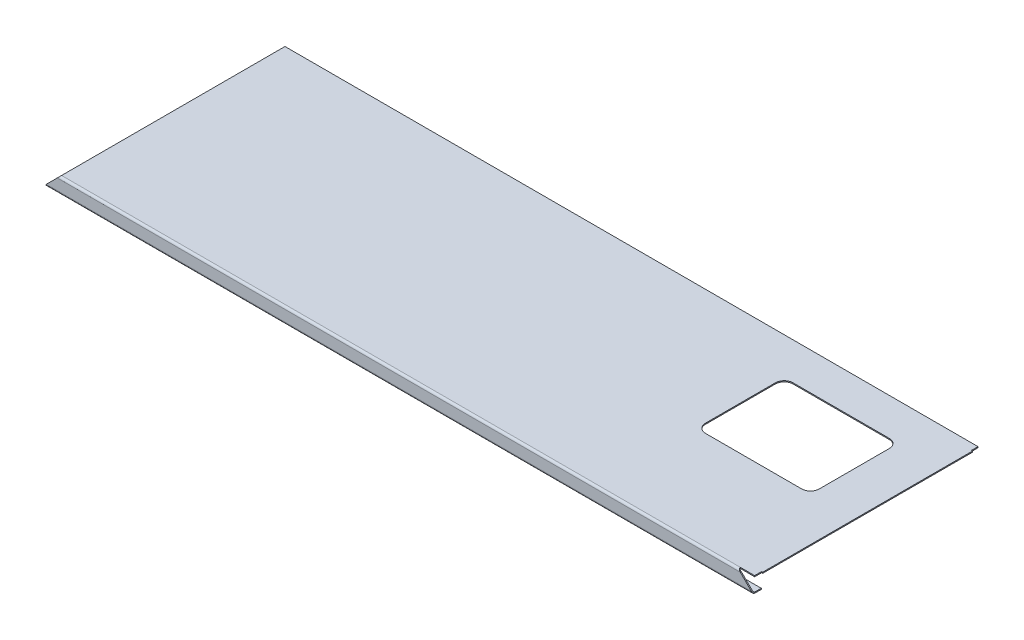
ISO-10303-21;
HEADER;
FILE_DESCRIPTION(('STEP AP214'),'2;1');
FILE_NAME('part.step','',(''),(''),'','','');
FILE_SCHEMA(('AUTOMOTIVE_DESIGN { 1 0 10303 214 1 1 1 1 }'));
ENDSEC;
DATA;
#1=APPLICATION_CONTEXT('core data for automotive mechanical design processes');
#2=APPLICATION_PROTOCOL_DEFINITION('international standard','automotive_design',2000,#1);
#3=PRODUCT_CONTEXT('',#1,'mechanical');
#4=PRODUCT('Part','Part','',(#3));
#5=PRODUCT_RELATED_PRODUCT_CATEGORY('part','',(#4));
#6=PRODUCT_DEFINITION_FORMATION('','',#4);
#7=PRODUCT_DEFINITION_CONTEXT('part definition',#1,'design');
#8=PRODUCT_DEFINITION('design','',#6,#7);
#9=PRODUCT_DEFINITION_SHAPE('','',#8);
#10=(LENGTH_UNIT() NAMED_UNIT(*) SI_UNIT(.MILLI.,.METRE.));
#11=(NAMED_UNIT(*) PLANE_ANGLE_UNIT() SI_UNIT($,.RADIAN.));
#12=(NAMED_UNIT(*) SI_UNIT($,.STERADIAN.) SOLID_ANGLE_UNIT());
#13=UNCERTAINTY_MEASURE_WITH_UNIT(LENGTH_MEASURE(1.E-05),#10,'distance_accuracy_value','');
#14=(GEOMETRIC_REPRESENTATION_CONTEXT(3) GLOBAL_UNCERTAINTY_ASSIGNED_CONTEXT((#13)) GLOBAL_UNIT_ASSIGNED_CONTEXT((#10,
#11,#12)) REPRESENTATION_CONTEXT('',''));
#15=CARTESIAN_POINT('',(0.,0.,0.));
#16=DIRECTION('',(0.,0.,1.));
#17=DIRECTION('',(1.,0.,0.));
#18=AXIS2_PLACEMENT_3D('',#15,#16,#17);
#19=CARTESIAN_POINT('',(0.,-3.048,0.));
#20=DIRECTION('',(0.,1.,0.));
#21=DIRECTION('',(0.,0.,1.));
#22=AXIS2_PLACEMENT_3D('',#19,#20,#21);
#23=PLANE('',#22);
#24=DIRECTION('',(1.,0.,0.));
#25=VECTOR('',#24,1.);
#26=CARTESIAN_POINT('',(1600.2,-3.048,107.95));
#27=LINE('',#26,#25);
#28=CARTESIAN_POINT('',(1625.6,-3.048,107.95));
#29=VERTEX_POINT('',#28);
#30=CARTESIAN_POINT('',(1905.,-3.048,107.95));
#31=VERTEX_POINT('',#30);
#32=EDGE_CURVE('E466',#29,#31,#27,.T.);
#33=ORIENTED_EDGE('',*,*,#32,.F.);
#34=CARTESIAN_POINT('',(1625.6,-3.048,133.35));
#35=DIRECTION('',(0.,1.,0.));
#36=DIRECTION('',(0.,0.,1.));
#37=AXIS2_PLACEMENT_3D('',#34,#35,#36);
#38=CIRCLE('',#37,25.4);
#39=CARTESIAN_POINT('',(1600.2,-3.048,133.35));
#40=VERTEX_POINT('',#39);
#41=EDGE_CURVE('E427',#29,#40,#38,.T.);
#42=ORIENTED_EDGE('',*,*,#41,.T.);
#43=DIRECTION('',(0.,0.,-1.));
#44=VECTOR('',#43,1.);
#45=CARTESIAN_POINT('',(1600.2,-3.048,361.95));
#46=LINE('',#45,#44);
#47=CARTESIAN_POINT('',(1600.2,-3.048,336.55));
#48=VERTEX_POINT('',#47);
#49=EDGE_CURVE('E440',#48,#40,#46,.T.);
#50=ORIENTED_EDGE('',*,*,#49,.F.);
#51=CARTESIAN_POINT('',(1625.6,-3.048,336.55));
#52=DIRECTION('',(0.,1.,0.));
#53=DIRECTION('',(0.,0.,1.));
#54=AXIS2_PLACEMENT_3D('',#51,#52,#53);
#55=CIRCLE('',#54,25.4);
#56=CARTESIAN_POINT('',(1625.6,-3.048,361.95));
#57=VERTEX_POINT('',#56);
#58=EDGE_CURVE('E96',#48,#57,#55,.T.);
#59=ORIENTED_EDGE('',*,*,#58,.T.);
#60=DIRECTION('',(-1.,0.,0.));
#61=VECTOR('',#60,1.);
#62=CARTESIAN_POINT('',(1600.2,-3.048,361.95));
#63=LINE('',#62,#61);
#64=CARTESIAN_POINT('',(1905.,-3.048,361.95));
#65=VERTEX_POINT('',#64);
#66=EDGE_CURVE('E438',#65,#57,#63,.T.);
#67=ORIENTED_EDGE('',*,*,#66,.F.);
#68=CARTESIAN_POINT('',(1905.,-3.048,336.55));
#69=DIRECTION('',(0.,1.,0.));
#70=DIRECTION('',(0.,0.,1.));
#71=AXIS2_PLACEMENT_3D('',#68,#69,#70);
#72=CIRCLE('',#71,25.4);
#73=CARTESIAN_POINT('',(1930.4,-3.048,336.55));
#74=VERTEX_POINT('',#73);
#75=EDGE_CURVE('E431',#65,#74,#72,.T.);
#76=ORIENTED_EDGE('',*,*,#75,.T.);
#77=DIRECTION('',(0.,0.,1.));
#78=VECTOR('',#77,1.);
#79=CARTESIAN_POINT('',(1930.4,-3.048,361.95));
#80=LINE('',#79,#78);
#81=CARTESIAN_POINT('',(1930.4,-3.048,133.35));
#82=VERTEX_POINT('',#81);
#83=EDGE_CURVE('E446',#82,#74,#80,.T.);
#84=ORIENTED_EDGE('',*,*,#83,.F.);
#85=CARTESIAN_POINT('',(1905.,-3.048,133.35));
#86=DIRECTION('',(0.,1.,0.));
#87=DIRECTION('',(0.,0.,1.));
#88=AXIS2_PLACEMENT_3D('',#85,#86,#87);
#89=CIRCLE('',#88,25.4);
#90=EDGE_CURVE('E423',#82,#31,#89,.T.);
#91=ORIENTED_EDGE('',*,*,#90,.T.);
#92=EDGE_LOOP('',(#33,#42,#50,#59,#67,#76,#84,#91));
#93=FACE_BOUND('',#92,.T.);
#94=DIRECTION('',(-1.,0.,0.));
#95=VECTOR('',#94,1.);
#96=CARTESIAN_POINT('',(0.,-3.048,627.1895));
#97=LINE('',#96,#95);
#98=CARTESIAN_POINT('',(2057.4,-3.048,627.1895));
#99=VERTEX_POINT('',#98);
#100=CARTESIAN_POINT('',(2054.352,-3.048,627.1895));
#101=VERTEX_POINT('',#100);
#102=EDGE_CURVE('E262',#99,#101,#97,.T.);
#103=ORIENTED_EDGE('',*,*,#102,.T.);
#104=DIRECTION('',(0.,0.,-1.));
#105=VECTOR('',#104,1.);
#106=CARTESIAN_POINT('',(2054.352,-3.048,0.));
#107=LINE('',#106,#105);
#108=CARTESIAN_POINT('',(2054.352,-3.048,647.827));
#109=VERTEX_POINT('',#108);
#110=EDGE_CURVE('E472',#109,#101,#107,.T.);
#111=ORIENTED_EDGE('',*,*,#110,.F.);
#112=DIRECTION('',(-1.,0.,0.));
#113=VECTOR('',#112,1.);
#114=CARTESIAN_POINT('',(2057.4,-3.048,647.827));
#115=LINE('',#114,#113);
#116=CARTESIAN_POINT('',(2012.95,-3.048,647.827));
#117=VERTEX_POINT('',#116);
#118=EDGE_CURVE('E285',#109,#117,#115,.T.);
#119=ORIENTED_EDGE('',*,*,#118,.T.);
#120=DIRECTION('',(-1.,0.,0.));
#121=VECTOR('',#120,1.);
#122=CARTESIAN_POINT('',(0.,-3.04800000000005,647.827));
#123=LINE('',#122,#121);
#124=CARTESIAN_POINT('',(44.4500000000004,-3.048,647.827));
#125=VERTEX_POINT('',#124);
#126=EDGE_CURVE('E393',#125,#117,#123,.F.);
#127=ORIENTED_EDGE('',*,*,#126,.F.);
#128=DIRECTION('',(0.,0.,1.));
#129=VECTOR('',#128,1.);
#130=CARTESIAN_POINT('',(44.4500000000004,-3.048,0.));
#131=LINE('',#130,#129);
#132=CARTESIAN_POINT('',(44.4500000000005,-3.048,0.));
#133=VERTEX_POINT('',#132);
#134=EDGE_CURVE('E354',#125,#133,#131,.F.);
#135=ORIENTED_EDGE('',*,*,#134,.T.);
#136=DIRECTION('',(-1.,0.,0.));
#137=VECTOR('',#136,1.);
#138=CARTESIAN_POINT('',(0.,-3.048,0.));
#139=LINE('',#138,#137);
#140=CARTESIAN_POINT('',(2054.225,-3.048,0.));
#141=VERTEX_POINT('',#140);
#142=EDGE_CURVE('E401',#141,#133,#139,.T.);
#143=ORIENTED_EDGE('',*,*,#142,.F.);
#144=DIRECTION('',(0.,0.,1.));
#145=VECTOR('',#144,1.);
#146=CARTESIAN_POINT('',(2054.225,-3.048,0.));
#147=LINE('',#146,#145);
#148=CARTESIAN_POINT('',(2054.225,-3.048,19.05));
#149=VERTEX_POINT('',#148);
#150=EDGE_CURVE('E464',#141,#149,#147,.T.);
#151=ORIENTED_EDGE('',*,*,#150,.T.);
#152=DIRECTION('',(-1.,0.,0.));
#153=VECTOR('',#152,1.);
#154=CARTESIAN_POINT('',(0.,-3.048,19.0500000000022));
#155=LINE('',#154,#153);
#156=CARTESIAN_POINT('',(2057.4,-3.048,19.05));
#157=VERTEX_POINT('',#156);
#158=EDGE_CURVE('E481',#157,#149,#155,.T.);
#159=ORIENTED_EDGE('',*,*,#158,.F.);
#160=DIRECTION('',(0.,0.,-1.));
#161=VECTOR('',#160,1.);
#162=CARTESIAN_POINT('',(2057.4,-3.048,647.827));
#163=LINE('',#162,#161);
#164=EDGE_CURVE('E283',#99,#157,#163,.T.);
#165=ORIENTED_EDGE('',*,*,#164,.F.);
#166=EDGE_LOOP('',(#103,#111,#119,#127,#135,#143,#151,#159,#165));
#167=FACE_BOUND('',#166,.T.);
#168=ADVANCED_FACE('F88',(#93,#167),#23,.F.);
#169=CARTESIAN_POINT('',(0.,0.,0.));
#170=DIRECTION('',(0.,1.,0.));
#171=DIRECTION('',(0.,0.,1.));
#172=AXIS2_PLACEMENT_3D('',#169,#170,#171);
#173=PLANE('',#172);
#174=DIRECTION('',(-1.,0.,0.));
#175=VECTOR('',#174,1.);
#176=CARTESIAN_POINT('',(1600.2,0.,361.95));
#177=LINE('',#176,#175);
#178=CARTESIAN_POINT('',(1905.,0.,361.95));
#179=VERTEX_POINT('',#178);
#180=CARTESIAN_POINT('',(1625.6,0.,361.95));
#181=VERTEX_POINT('',#180);
#182=EDGE_CURVE('E452',#179,#181,#177,.T.);
#183=ORIENTED_EDGE('',*,*,#182,.T.);
#184=CARTESIAN_POINT('',(1625.6,0.,336.55));
#185=DIRECTION('',(0.,1.,0.));
#186=DIRECTION('',(0.,0.,1.));
#187=AXIS2_PLACEMENT_3D('',#184,#185,#186);
#188=CIRCLE('',#187,25.4);
#189=CARTESIAN_POINT('',(1600.2,0.,336.55));
#190=VERTEX_POINT('',#189);
#191=EDGE_CURVE('E13',#181,#190,#188,.F.);
#192=ORIENTED_EDGE('',*,*,#191,.T.);
#193=DIRECTION('',(0.,0.,-1.));
#194=VECTOR('',#193,1.);
#195=CARTESIAN_POINT('',(1600.2,0.,361.95));
#196=LINE('',#195,#194);
#197=CARTESIAN_POINT('',(1600.2,0.,133.35));
#198=VERTEX_POINT('',#197);
#199=EDGE_CURVE('E445',#190,#198,#196,.T.);
#200=ORIENTED_EDGE('',*,*,#199,.T.);
#201=CARTESIAN_POINT('',(1625.6,0.,133.35));
#202=DIRECTION('',(0.,1.,0.));
#203=DIRECTION('',(0.,0.,1.));
#204=AXIS2_PLACEMENT_3D('',#201,#202,#203);
#205=CIRCLE('',#204,25.4);
#206=CARTESIAN_POINT('',(1625.6,0.,107.95));
#207=VERTEX_POINT('',#206);
#208=EDGE_CURVE('E429',#198,#207,#205,.F.);
#209=ORIENTED_EDGE('',*,*,#208,.T.);
#210=DIRECTION('',(1.,0.,0.));
#211=VECTOR('',#210,1.);
#212=CARTESIAN_POINT('',(1600.2,0.,107.95));
#213=LINE('',#212,#211);
#214=CARTESIAN_POINT('',(1905.,0.,107.95));
#215=VERTEX_POINT('',#214);
#216=EDGE_CURVE('E456',#207,#215,#213,.T.);
#217=ORIENTED_EDGE('',*,*,#216,.T.);
#218=CARTESIAN_POINT('',(1905.,0.,133.35));
#219=DIRECTION('',(0.,1.,0.));
#220=DIRECTION('',(0.,0.,1.));
#221=AXIS2_PLACEMENT_3D('',#218,#219,#220);
#222=CIRCLE('',#221,25.4);
#223=CARTESIAN_POINT('',(1930.4,0.,133.35));
#224=VERTEX_POINT('',#223);
#225=EDGE_CURVE('E425',#215,#224,#222,.F.);
#226=ORIENTED_EDGE('',*,*,#225,.T.);
#227=DIRECTION('',(0.,0.,1.));
#228=VECTOR('',#227,1.);
#229=CARTESIAN_POINT('',(1930.4,0.,361.95));
#230=LINE('',#229,#228);
#231=CARTESIAN_POINT('',(1930.4,0.,336.55));
#232=VERTEX_POINT('',#231);
#233=EDGE_CURVE('E459',#224,#232,#230,.T.);
#234=ORIENTED_EDGE('',*,*,#233,.T.);
#235=CARTESIAN_POINT('',(1905.,0.,336.55));
#236=DIRECTION('',(0.,1.,0.));
#237=DIRECTION('',(0.,0.,1.));
#238=AXIS2_PLACEMENT_3D('',#235,#236,#237);
#239=CIRCLE('',#238,25.4);
#240=EDGE_CURVE('E110',#232,#179,#239,.F.);
#241=ORIENTED_EDGE('',*,*,#240,.T.);
#242=EDGE_LOOP('',(#183,#192,#200,#209,#217,#226,#234,#241));
#243=FACE_BOUND('',#242,.T.);
#244=DIRECTION('',(0.,0.,1.));
#245=VECTOR('',#244,1.);
#246=CARTESIAN_POINT('',(2054.352,0.,0.));
#247=LINE('',#246,#245);
#248=CARTESIAN_POINT('',(2054.352,0.,647.827));
#249=VERTEX_POINT('',#248);
#250=CARTESIAN_POINT('',(2054.352,0.,627.1895));
#251=VERTEX_POINT('',#250);
#252=EDGE_CURVE('E277',#249,#251,#247,.F.);
#253=ORIENTED_EDGE('',*,*,#252,.T.);
#254=DIRECTION('',(1.,0.,0.));
#255=VECTOR('',#254,1.);
#256=CARTESIAN_POINT('',(0.,0.,627.1895));
#257=LINE('',#256,#255);
#258=CARTESIAN_POINT('',(2057.4,0.,627.1895));
#259=VERTEX_POINT('',#258);
#260=EDGE_CURVE('E259',#259,#251,#257,.F.);
#261=ORIENTED_EDGE('',*,*,#260,.F.);
#262=DIRECTION('',(0.,0.,1.));
#263=VECTOR('',#262,1.);
#264=CARTESIAN_POINT('',(2057.4,0.,647.827));
#265=LINE('',#264,#263);
#266=CARTESIAN_POINT('',(2057.4,0.,19.05));
#267=VERTEX_POINT('',#266);
#268=EDGE_CURVE('E275',#267,#259,#265,.T.);
#269=ORIENTED_EDGE('',*,*,#268,.F.);
#270=DIRECTION('',(1.,0.,0.));
#271=VECTOR('',#270,1.);
#272=CARTESIAN_POINT('',(0.,0.,19.05));
#273=LINE('',#272,#271);
#274=CARTESIAN_POINT('',(2054.225,0.,19.05));
#275=VERTEX_POINT('',#274);
#276=EDGE_CURVE('E480',#267,#275,#273,.F.);
#277=ORIENTED_EDGE('',*,*,#276,.T.);
#278=DIRECTION('',(0.,0.,1.));
#279=VECTOR('',#278,1.);
#280=CARTESIAN_POINT('',(2054.225,0.,0.));
#281=LINE('',#280,#279);
#282=CARTESIAN_POINT('',(2054.225,0.,0.));
#283=VERTEX_POINT('',#282);
#284=EDGE_CURVE('E478',#283,#275,#281,.T.);
#285=ORIENTED_EDGE('',*,*,#284,.F.);
#286=DIRECTION('',(-1.,0.,0.));
#287=VECTOR('',#286,1.);
#288=CARTESIAN_POINT('',(0.,0.,0.));
#289=LINE('',#288,#287);
#290=CARTESIAN_POINT('',(44.4500000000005,0.,0.));
#291=VERTEX_POINT('',#290);
#292=EDGE_CURVE('E398',#283,#291,#289,.T.);
#293=ORIENTED_EDGE('',*,*,#292,.T.);
#294=DIRECTION('',(0.,0.,-1.));
#295=VECTOR('',#294,1.);
#296=CARTESIAN_POINT('',(44.4500000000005,0.,3353.19684582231));
#297=LINE('',#296,#295);
#298=CARTESIAN_POINT('',(44.4500000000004,0.,647.827));
#299=VERTEX_POINT('',#298);
#300=EDGE_CURVE('E331',#299,#291,#297,.T.);
#301=ORIENTED_EDGE('',*,*,#300,.F.);
#302=DIRECTION('',(-1.,0.,0.));
#303=VECTOR('',#302,1.);
#304=CARTESIAN_POINT('',(0.,0.,647.827));
#305=LINE('',#304,#303);
#306=CARTESIAN_POINT('',(2012.95,0.,647.827));
#307=VERTEX_POINT('',#306);
#308=EDGE_CURVE('E395',#299,#307,#305,.F.);
#309=ORIENTED_EDGE('',*,*,#308,.T.);
#310=DIRECTION('',(-1.,0.,0.));
#311=VECTOR('',#310,1.);
#312=CARTESIAN_POINT('',(2057.4,0.,647.827));
#313=LINE('',#312,#311);
#314=EDGE_CURVE('E282',#249,#307,#313,.T.);
#315=ORIENTED_EDGE('',*,*,#314,.F.);
#316=EDGE_LOOP('',(#253,#261,#269,#277,#285,#293,#301,#309,#315));
#317=FACE_BOUND('',#316,.T.);
#318=ADVANCED_FACE('F273',(#243,#317),#173,.T.);
#319=CARTESIAN_POINT('',(0.,-3.048,0.));
#320=DIRECTION('',(0.,0.,-1.));
#321=DIRECTION('',(-1.,0.,0.));
#322=AXIS2_PLACEMENT_3D('',#319,#320,#321);
#323=PLANE('',#322);
#324=ORIENTED_EDGE('',*,*,#292,.F.);
#325=DIRECTION('',(0.,-1.,0.));
#326=VECTOR('',#325,1.);
#327=CARTESIAN_POINT('',(2054.225,-3.048,0.));
#328=LINE('',#327,#326);
#329=EDGE_CURVE('E483',#141,#283,#328,.F.);
#330=ORIENTED_EDGE('',*,*,#329,.F.);
#331=ORIENTED_EDGE('',*,*,#142,.T.);
#332=DIRECTION('',(0.,1.,0.));
#333=VECTOR('',#332,1.);
#334=CARTESIAN_POINT('',(44.4500000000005,0.,0.));
#335=LINE('',#334,#333);
#336=EDGE_CURVE('E357',#291,#133,#335,.F.);
#337=ORIENTED_EDGE('',*,*,#336,.F.);
#338=EDGE_LOOP('',(#324,#330,#331,#337));
#339=FACE_BOUND('',#338,.T.);
#340=ADVANCED_FACE('F500',(#339),#323,.T.);
#341=CARTESIAN_POINT('',(2057.4,0.,647.827));
#342=DIRECTION('',(0.,0.,-1.));
#343=DIRECTION('',(-1.,0.,0.));
#344=AXIS2_PLACEMENT_3D('',#341,#342,#343);
#345=PLANE('',#344);
#346=DIRECTION('',(0.,-1.,0.));
#347=VECTOR('',#346,1.);
#348=CARTESIAN_POINT('',(2054.352,-3.048,647.827));
#349=LINE('',#348,#347);
#350=EDGE_CURVE('E268',#109,#249,#349,.F.);
#351=ORIENTED_EDGE('',*,*,#350,.T.);
#352=ORIENTED_EDGE('',*,*,#314,.T.);
#353=DIRECTION('',(0.,1.,0.));
#354=VECTOR('',#353,1.);
#355=CARTESIAN_POINT('',(2012.95,0.,647.827));
#356=LINE('',#355,#354);
#357=EDGE_CURVE('E313',#307,#117,#356,.F.);
#358=ORIENTED_EDGE('',*,*,#357,.T.);
#359=ORIENTED_EDGE('',*,*,#118,.F.);
#360=EDGE_LOOP('',(#351,#352,#358,#359));
#361=FACE_BOUND('',#360,.T.);
#362=ADVANCED_FACE('F517',(#361),#345,.F.);
#363=CARTESIAN_POINT('',(2057.4,0.,0.));
#364=DIRECTION('',(1.,0.,0.));
#365=DIRECTION('',(0.,0.,-1.));
#366=AXIS2_PLACEMENT_3D('',#363,#364,#365);
#367=PLANE('',#366);
#368=ORIENTED_EDGE('',*,*,#268,.T.);
#369=DIRECTION('',(0.,-1.,0.));
#370=VECTOR('',#369,1.);
#371=CARTESIAN_POINT('',(2057.4,-3.048,627.1895));
#372=LINE('',#371,#370);
#373=EDGE_CURVE('E255',#99,#259,#372,.F.);
#374=ORIENTED_EDGE('',*,*,#373,.F.);
#375=ORIENTED_EDGE('',*,*,#164,.T.);
#376=DIRECTION('',(0.,-1.,0.));
#377=VECTOR('',#376,1.);
#378=CARTESIAN_POINT('',(2057.4,-3.048,19.05));
#379=LINE('',#378,#377);
#380=EDGE_CURVE('E281',#157,#267,#379,.F.);
#381=ORIENTED_EDGE('',*,*,#380,.T.);
#382=EDGE_LOOP('',(#368,#374,#375,#381));
#383=FACE_BOUND('',#382,.T.);
#384=ADVANCED_FACE('F280',(#383),#367,.T.);
#385=CARTESIAN_POINT('',(0.,1.76452196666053E-12,654.05));
#386=DIRECTION('',(0.,0.,-1.));
#387=DIRECTION('',(0.,1.,0.));
#388=AXIS2_PLACEMENT_3D('',#385,#386,#387);
#389=PLANE('',#388);
#390=DIRECTION('',(-0.707106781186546,0.707106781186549,0.));
#391=VECTOR('',#390,1.);
#392=CARTESIAN_POINT('',(1006.475,1006.475,654.049999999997));
#393=LINE('',#392,#391);
#394=CARTESIAN_POINT('',(2051.177,-38.227,654.05));
#395=VERTEX_POINT('',#394);
#396=CARTESIAN_POINT('',(2019.173,-6.22300000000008,654.05));
#397=VERTEX_POINT('',#396);
#398=EDGE_CURVE('E303',#395,#397,#393,.T.);
#399=ORIENTED_EDGE('',*,*,#398,.T.);
#400=DIRECTION('',(-1.,0.,0.));
#401=VECTOR('',#400,1.);
#402=CARTESIAN_POINT('',(2057.4,-6.22300000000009,654.05));
#403=LINE('',#402,#401);
#404=CARTESIAN_POINT('',(38.2270000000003,-6.22300000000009,654.05));
#405=VERTEX_POINT('',#404);
#406=EDGE_CURVE('E390',#405,#397,#403,.F.);
#407=ORIENTED_EDGE('',*,*,#406,.F.);
#408=DIRECTION('',(0.707106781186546,0.707106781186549,0.));
#409=VECTOR('',#408,1.);
#410=CARTESIAN_POINT('',(22.2250000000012,-22.2249999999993,654.05));
#411=LINE('',#410,#409);
#412=CARTESIAN_POINT('',(6.22300000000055,-38.227,654.05));
#413=VERTEX_POINT('',#412);
#414=EDGE_CURVE('E351',#413,#405,#411,.T.);
#415=ORIENTED_EDGE('',*,*,#414,.F.);
#416=DIRECTION('',(-1.,0.,0.));
#417=VECTOR('',#416,1.);
#418=CARTESIAN_POINT('',(4.44089209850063E-13,-38.227,654.05));
#419=LINE('',#418,#417);
#420=EDGE_CURVE('E384',#413,#395,#419,.F.);
#421=ORIENTED_EDGE('',*,*,#420,.T.);
#422=EDGE_LOOP('',(#399,#407,#415,#421));
#423=FACE_BOUND('',#422,.T.);
#424=ADVANCED_FACE('F523',(#423),#389,.F.);
#425=CARTESIAN_POINT('',(0.,1.75387993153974E-12,651.002));
#426=DIRECTION('',(0.,0.,-1.));
#427=DIRECTION('',(0.,1.,0.));
#428=AXIS2_PLACEMENT_3D('',#425,#426,#427);
#429=PLANE('',#428);
#430=DIRECTION('',(-1.,0.,0.));
#431=VECTOR('',#430,1.);
#432=CARTESIAN_POINT('',(2057.4,-6.22300000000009,651.002));
#433=LINE('',#432,#431);
#434=CARTESIAN_POINT('',(2019.173,-6.22300000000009,651.002));
#435=VERTEX_POINT('',#434);
#436=CARTESIAN_POINT('',(38.2270000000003,-6.22300000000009,651.002));
#437=VERTEX_POINT('',#436);
#438=EDGE_CURVE('E387',#435,#437,#433,.T.);
#439=ORIENTED_EDGE('',*,*,#438,.F.);
#440=DIRECTION('',(-0.707106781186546,0.707106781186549,0.));
#441=VECTOR('',#440,1.);
#442=CARTESIAN_POINT('',(1006.475,1006.475,651.001999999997));
#443=LINE('',#442,#441);
#444=CARTESIAN_POINT('',(2051.177,-38.227,651.002));
#445=VERTEX_POINT('',#444);
#446=EDGE_CURVE('E307',#445,#435,#443,.T.);
#447=ORIENTED_EDGE('',*,*,#446,.F.);
#448=DIRECTION('',(-1.,0.,0.));
#449=VECTOR('',#448,1.);
#450=CARTESIAN_POINT('',(4.44089209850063E-13,-38.227,651.002));
#451=LINE('',#450,#449);
#452=CARTESIAN_POINT('',(6.22300000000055,-38.227,651.002));
#453=VERTEX_POINT('',#452);
#454=EDGE_CURVE('E378',#453,#445,#451,.F.);
#455=ORIENTED_EDGE('',*,*,#454,.F.);
#456=DIRECTION('',(0.707106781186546,0.707106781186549,0.));
#457=VECTOR('',#456,1.);
#458=CARTESIAN_POINT('',(22.2250000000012,-22.2249999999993,651.002));
#459=LINE('',#458,#457);
#460=EDGE_CURVE('E364',#453,#437,#459,.T.);
#461=ORIENTED_EDGE('',*,*,#460,.T.);
#462=EDGE_LOOP('',(#439,#447,#455,#461));
#463=FACE_BOUND('',#462,.T.);
#464=ADVANCED_FACE('F555',(#463),#429,.T.);
#465=CARTESIAN_POINT('',(0.,-6.22300000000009,647.827));
#466=DIRECTION('',(-1.,0.,0.));
#467=DIRECTION('',(0.,0.,1.));
#468=AXIS2_PLACEMENT_3D('',#465,#466,#467);
#469=CYLINDRICAL_SURFACE('',#468,6.22300000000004);
#470=ORIENTED_EDGE('',*,*,#406,.T.);
#471=CARTESIAN_POINT('',(2019.173,-6.22300000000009,647.827));
#472=DIRECTION('',(-0.707106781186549,-0.707106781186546,0.));
#473=DIRECTION('',(-0.707106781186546,0.707106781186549,0.));
#474=AXIS2_PLACEMENT_3D('',#471,#472,#473);
#475=ELLIPSE('',#474,8.80065099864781,6.22300000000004);
#476=EDGE_CURVE('E296',#307,#397,#475,.F.);
#477=ORIENTED_EDGE('',*,*,#476,.F.);
#478=ORIENTED_EDGE('',*,*,#308,.F.);
#479=CARTESIAN_POINT('',(38.2270000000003,-6.22300000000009,647.827));
#480=DIRECTION('',(-0.707106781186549,0.707106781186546,0.));
#481=DIRECTION('',(-0.707106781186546,-0.707106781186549,0.));
#482=AXIS2_PLACEMENT_3D('',#479,#480,#481);
#483=ELLIPSE('',#482,8.80065099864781,6.22300000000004);
#484=EDGE_CURVE('E332',#299,#405,#483,.F.);
#485=ORIENTED_EDGE('',*,*,#484,.T.);
#486=EDGE_LOOP('',(#470,#477,#478,#485));
#487=FACE_BOUND('',#486,.T.);
#488=ADVANCED_FACE('F520',(#487),#469,.T.);
#489=CARTESIAN_POINT('',(0.,-6.22300000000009,647.827));
#490=DIRECTION('',(-1.,0.,0.));
#491=DIRECTION('',(0.,0.,1.));
#492=AXIS2_PLACEMENT_3D('',#489,#490,#491);
#493=CYLINDRICAL_SURFACE('',#492,3.17500000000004);
#494=CARTESIAN_POINT('',(2019.173,-6.22300000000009,647.827));
#495=DIRECTION('',(-0.454470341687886,-0.890761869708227,0.));
#496=DIRECTION('',(-0.890761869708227,0.454470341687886,0.));
#497=AXIS2_PLACEMENT_3D('',#494,#495,#496);
#498=ELLIPSE('',#497,6.98615445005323,3.17500000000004);
#499=EDGE_CURVE('E292',#117,#435,#498,.F.);
#500=ORIENTED_EDGE('',*,*,#499,.T.);
#501=ORIENTED_EDGE('',*,*,#438,.T.);
#502=CARTESIAN_POINT('',(38.2270000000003,-6.22300000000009,647.827));
#503=DIRECTION('',(-0.454470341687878,0.890761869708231,0.));
#504=DIRECTION('',(-0.890761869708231,-0.454470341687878,0.));
#505=AXIS2_PLACEMENT_3D('',#502,#503,#504);
#506=ELLIPSE('',#505,6.98615445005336,3.17500000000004);
#507=EDGE_CURVE('E328',#125,#437,#506,.F.);
#508=ORIENTED_EDGE('',*,*,#507,.F.);
#509=ORIENTED_EDGE('',*,*,#126,.T.);
#510=EDGE_LOOP('',(#500,#501,#508,#509));
#511=FACE_BOUND('',#510,.T.);
#512=ADVANCED_FACE('F510',(#511),#493,.F.);
#513=CARTESIAN_POINT('',(4.44089209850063E-13,-38.227,647.827));
#514=DIRECTION('',(-1.,0.,0.));
#515=DIRECTION('',(0.,-1.,0.));
#516=AXIS2_PLACEMENT_3D('',#513,#514,#515);
#517=CYLINDRICAL_SURFACE('',#516,6.22299999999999);
#518=DIRECTION('',(-1.,0.,0.));
#519=VECTOR('',#518,1.);
#520=CARTESIAN_POINT('',(0.,-44.45,647.827));
#521=LINE('',#520,#519);
#522=CARTESIAN_POINT('',(2054.352,-44.45,647.827));
#523=VERTEX_POINT('',#522);
#524=CARTESIAN_POINT('',(3.04800000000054,-44.45,647.827));
#525=VERTEX_POINT('',#524);
#526=EDGE_CURVE('E381',#523,#525,#521,.T.);
#527=ORIENTED_EDGE('',*,*,#526,.F.);
#528=CARTESIAN_POINT('',(2051.177,-38.227,647.827));
#529=DIRECTION('',(-0.890761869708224,-0.454470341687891,0.));
#530=DIRECTION('',(-0.454470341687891,0.890761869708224,0.));
#531=AXIS2_PLACEMENT_3D('',#528,#529,#530);
#532=ELLIPSE('',#531,6.9861544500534,6.22299999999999);
#533=EDGE_CURVE('E299',#395,#523,#532,.F.);
#534=ORIENTED_EDGE('',*,*,#533,.F.);
#535=ORIENTED_EDGE('',*,*,#420,.F.);
#536=CARTESIAN_POINT('',(6.22300000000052,-38.227,647.827));
#537=DIRECTION('',(-0.890761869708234,0.454470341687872,0.));
#538=DIRECTION('',(-0.454470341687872,-0.890761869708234,0.));
#539=AXIS2_PLACEMENT_3D('',#536,#537,#538);
#540=ELLIPSE('',#539,6.98615445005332,6.22299999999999);
#541=EDGE_CURVE('E335',#413,#525,#540,.F.);
#542=ORIENTED_EDGE('',*,*,#541,.T.);
#543=EDGE_LOOP('',(#527,#534,#535,#542));
#544=FACE_BOUND('',#543,.T.);
#545=ADVANCED_FACE('F535',(#544),#517,.T.);
#546=CARTESIAN_POINT('',(4.44089209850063E-13,-38.227,647.827));
#547=DIRECTION('',(-1.,0.,0.));
#548=DIRECTION('',(0.,-1.,0.));
#549=AXIS2_PLACEMENT_3D('',#546,#547,#548);
#550=CYLINDRICAL_SURFACE('',#549,3.17499999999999);
#551=CARTESIAN_POINT('',(2051.177,-38.227,647.827));
#552=DIRECTION('',(-0.707106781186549,-0.707106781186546,0.));
#553=DIRECTION('',(-0.707106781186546,0.707106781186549,0.));
#554=AXIS2_PLACEMENT_3D('',#551,#552,#553);
#555=ELLIPSE('',#554,4.49012806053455,3.17499999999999);
#556=CARTESIAN_POINT('',(2054.352,-41.402,647.827));
#557=VERTEX_POINT('',#556);
#558=EDGE_CURVE('E291',#445,#557,#555,.F.);
#559=ORIENTED_EDGE('',*,*,#558,.T.);
#560=DIRECTION('',(1.,0.,0.));
#561=VECTOR('',#560,1.);
#562=CARTESIAN_POINT('',(2057.4,-41.402,647.827));
#563=LINE('',#562,#561);
#564=CARTESIAN_POINT('',(3.04800000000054,-41.402,647.827));
#565=VERTEX_POINT('',#564);
#566=EDGE_CURVE('E373',#557,#565,#563,.F.);
#567=ORIENTED_EDGE('',*,*,#566,.T.);
#568=CARTESIAN_POINT('',(6.22300000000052,-38.227,647.827));
#569=DIRECTION('',(-0.707106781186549,0.707106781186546,0.));
#570=DIRECTION('',(-0.707106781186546,-0.707106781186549,0.));
#571=AXIS2_PLACEMENT_3D('',#568,#569,#570);
#572=ELLIPSE('',#571,4.49012806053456,3.17499999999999);
#573=EDGE_CURVE('E327',#453,#565,#572,.F.);
#574=ORIENTED_EDGE('',*,*,#573,.F.);
#575=ORIENTED_EDGE('',*,*,#454,.T.);
#576=EDGE_LOOP('',(#559,#567,#574,#575));
#577=FACE_BOUND('',#576,.T.);
#578=ADVANCED_FACE('F552',(#577),#550,.F.);
#579=CARTESIAN_POINT('',(0.,-44.450000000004,2.86620769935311E-13));
#580=DIRECTION('',(0.,-1.,0.));
#581=DIRECTION('',(0.,0.,-1.));
#582=AXIS2_PLACEMENT_3D('',#579,#580,#581);
#583=PLANE('',#582);
#584=DIRECTION('',(-1.,0.,0.));
#585=VECTOR('',#584,1.);
#586=CARTESIAN_POINT('',(0.,-44.4500000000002,628.65));
#587=LINE('',#586,#585);
#588=CARTESIAN_POINT('',(2054.352,-44.4500000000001,628.65));
#589=VERTEX_POINT('',#588);
#590=CARTESIAN_POINT('',(3.04800000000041,-44.4500000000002,628.65));
#591=VERTEX_POINT('',#590);
#592=EDGE_CURVE('E376',#589,#591,#587,.T.);
#593=ORIENTED_EDGE('',*,*,#592,.F.);
#594=DIRECTION('',(0.,0.,-1.));
#595=VECTOR('',#594,1.);
#596=CARTESIAN_POINT('',(2054.352,-44.450000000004,2.86729569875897E-13));
#597=LINE('',#596,#595);
#598=EDGE_CURVE('E316',#523,#589,#597,.T.);
#599=ORIENTED_EDGE('',*,*,#598,.F.);
#600=ORIENTED_EDGE('',*,*,#526,.T.);
#601=DIRECTION('',(0.,0.,-1.));
#602=VECTOR('',#601,1.);
#603=CARTESIAN_POINT('',(3.04800000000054,-44.450000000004,2.86729569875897E-13));
#604=LINE('',#603,#602);
#605=EDGE_CURVE('E340',#525,#591,#604,.T.);
#606=ORIENTED_EDGE('',*,*,#605,.T.);
#607=EDGE_LOOP('',(#593,#599,#600,#606));
#608=FACE_BOUND('',#607,.T.);
#609=ADVANCED_FACE('F541',(#608),#583,.T.);
#610=CARTESIAN_POINT('',(0.,-41.402000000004,2.67805313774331E-13));
#611=DIRECTION('',(0.,-1.,0.));
#612=DIRECTION('',(0.,0.,-1.));
#613=AXIS2_PLACEMENT_3D('',#610,#611,#612);
#614=PLANE('',#613);
#615=DIRECTION('',(0.,0.,-1.));
#616=VECTOR('',#615,1.);
#617=CARTESIAN_POINT('',(2054.352,-41.402000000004,1.30227539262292E-11));
#618=LINE('',#617,#616);
#619=CARTESIAN_POINT('',(2054.352,-41.4020000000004,628.65));
#620=VERTEX_POINT('',#619);
#621=EDGE_CURVE('E295',#557,#620,#618,.T.);
#622=ORIENTED_EDGE('',*,*,#621,.T.);
#623=DIRECTION('',(1.,0.,0.));
#624=VECTOR('',#623,1.);
#625=CARTESIAN_POINT('',(0.,-41.4020000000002,628.65));
#626=LINE('',#625,#624);
#627=CARTESIAN_POINT('',(3.04800000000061,-41.4020000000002,628.65));
#628=VERTEX_POINT('',#627);
#629=EDGE_CURVE('E379',#620,#628,#626,.F.);
#630=ORIENTED_EDGE('',*,*,#629,.T.);
#631=DIRECTION('',(0.,0.,-1.));
#632=VECTOR('',#631,1.);
#633=CARTESIAN_POINT('',(3.04799999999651,-41.402000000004,2.48881057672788E-13));
#634=LINE('',#633,#632);
#635=EDGE_CURVE('E344',#565,#628,#634,.T.);
#636=ORIENTED_EDGE('',*,*,#635,.F.);
#637=ORIENTED_EDGE('',*,*,#566,.F.);
#638=EDGE_LOOP('',(#622,#630,#636,#637));
#639=FACE_BOUND('',#638,.T.);
#640=ADVANCED_FACE('F568',(#639),#614,.F.);
#641=CARTESIAN_POINT('',(0.,-44.4500000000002,628.65));
#642=DIRECTION('',(0.,0.,-1.));
#643=DIRECTION('',(0.,1.,0.));
#644=AXIS2_PLACEMENT_3D('',#641,#642,#643);
#645=PLANE('',#644);
#646=ORIENTED_EDGE('',*,*,#629,.F.);
#647=DIRECTION('',(0.,1.,0.));
#648=VECTOR('',#647,1.);
#649=CARTESIAN_POINT('',(2054.352,-41.4020000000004,628.65));
#650=LINE('',#649,#648);
#651=EDGE_CURVE('E310',#620,#589,#650,.F.);
#652=ORIENTED_EDGE('',*,*,#651,.T.);
#653=ORIENTED_EDGE('',*,*,#592,.T.);
#654=DIRECTION('',(0.,1.,0.));
#655=VECTOR('',#654,1.);
#656=CARTESIAN_POINT('',(3.04800000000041,-41.4020000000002,628.65));
#657=LINE('',#656,#655);
#658=EDGE_CURVE('E348',#628,#591,#657,.F.);
#659=ORIENTED_EDGE('',*,*,#658,.F.);
#660=EDGE_LOOP('',(#646,#652,#653,#659));
#661=FACE_BOUND('',#660,.T.);
#662=ADVANCED_FACE('F561',(#661),#645,.T.);
#663=CARTESIAN_POINT('',(22.2250000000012,-22.2249999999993,654.05));
#664=DIRECTION('',(-0.707106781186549,0.707106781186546,0.));
#665=DIRECTION('',(0.707106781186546,0.707106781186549,0.));
#666=AXIS2_PLACEMENT_3D('',#663,#664,#665);
#667=PLANE('',#666);
#668=ORIENTED_EDGE('',*,*,#414,.T.);
#669=DIRECTION('',(0.,0.,1.));
#670=VECTOR('',#669,1.);
#671=CARTESIAN_POINT('',(38.2270000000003,-6.22300000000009,654.05));
#672=LINE('',#671,#670);
#673=EDGE_CURVE('E370',#405,#437,#672,.F.);
#674=ORIENTED_EDGE('',*,*,#673,.T.);
#675=ORIENTED_EDGE('',*,*,#460,.F.);
#676=DIRECTION('',(0.,0.,1.));
#677=VECTOR('',#676,1.);
#678=CARTESIAN_POINT('',(6.22300000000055,-38.227,654.05));
#679=LINE('',#678,#677);
#680=EDGE_CURVE('E367',#413,#453,#679,.F.);
#681=ORIENTED_EDGE('',*,*,#680,.F.);
#682=EDGE_LOOP('',(#668,#674,#675,#681));
#683=FACE_BOUND('',#682,.T.);
#684=ADVANCED_FACE('F559',(#683),#667,.T.);
#685=CARTESIAN_POINT('',(3.04799999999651,-41.402000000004,2.48881057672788E-13));
#686=DIRECTION('',(-1.,0.,0.));
#687=DIRECTION('',(0.,0.,-1.));
#688=AXIS2_PLACEMENT_3D('',#685,#686,#687);
#689=PLANE('',#688);
#690=ORIENTED_EDGE('',*,*,#635,.T.);
#691=ORIENTED_EDGE('',*,*,#658,.T.);
#692=ORIENTED_EDGE('',*,*,#605,.F.);
#693=DIRECTION('',(0.,1.,0.));
#694=VECTOR('',#693,1.);
#695=CARTESIAN_POINT('',(3.04800000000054,-41.402,647.827));
#696=LINE('',#695,#694);
#697=EDGE_CURVE('E343',#565,#525,#696,.F.);
#698=ORIENTED_EDGE('',*,*,#697,.F.);
#699=EDGE_LOOP('',(#690,#691,#692,#698));
#700=FACE_BOUND('',#699,.T.);
#701=ADVANCED_FACE('F544',(#700),#689,.T.);
#702=CARTESIAN_POINT('',(3.04800000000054,-44.45,647.827));
#703=CARTESIAN_POINT('',(3.04800000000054,-43.434,647.827));
#704=CARTESIAN_POINT('',(3.04800000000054,-42.418,647.827));
#705=CARTESIAN_POINT('',(3.04800000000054,-41.402,647.827));
#706=CARTESIAN_POINT('',(3.04800000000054,-44.45,635.381));
#707=CARTESIAN_POINT('',(3.04800000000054,-43.434,637.413));
#708=CARTESIAN_POINT('',(3.04800000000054,-42.418,639.445));
#709=CARTESIAN_POINT('',(3.04800000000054,-41.402,641.477));
#710=CARTESIAN_POINT('',(9.3980000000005,-32.004,635.381));
#711=CARTESIAN_POINT('',(9.39800000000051,-33.0200000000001,637.413));
#712=CARTESIAN_POINT('',(9.39800000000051,-34.036,639.445));
#713=CARTESIAN_POINT('',(9.3980000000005,-35.052,641.477));
#714=CARTESIAN_POINT('',(9.3980000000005,-32.004,647.827));
#715=CARTESIAN_POINT('',(9.3980000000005,-33.02,647.827));
#716=CARTESIAN_POINT('',(9.3980000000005,-34.036,647.827));
#717=CARTESIAN_POINT('',(9.3980000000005,-35.052,647.827));
#718=CARTESIAN_POINT('',(9.3980000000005,-32.004,660.273));
#719=CARTESIAN_POINT('',(9.39800000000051,-33.0200000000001,658.241));
#720=CARTESIAN_POINT('',(9.39800000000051,-34.036,656.209));
#721=CARTESIAN_POINT('',(9.3980000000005,-35.052,654.177));
#722=CARTESIAN_POINT('',(3.04800000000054,-44.45,660.273));
#723=CARTESIAN_POINT('',(3.04800000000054,-43.434,658.241));
#724=CARTESIAN_POINT('',(3.04800000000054,-42.418,656.209));
#725=CARTESIAN_POINT('',(3.04800000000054,-41.402,654.177));
#726=CARTESIAN_POINT('',(3.04800000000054,-44.45,647.827));
#727=CARTESIAN_POINT('',(3.04800000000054,-43.434,647.827));
#728=CARTESIAN_POINT('',(3.04800000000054,-42.418,647.827));
#729=CARTESIAN_POINT('',(3.04800000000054,-41.402,647.827));
#730=(BOUNDED_SURFACE() B_SPLINE_SURFACE(3,3,((#702,#703,#704,#705),(#706,#707,#708,#709),(#710,
#711,#712,#713),(#714,#715,#716,#717),(#718,#719,#720,#721),(#722,#723,#724,#725),(#726,#727,
#728,#729)),.UNSPECIFIED.,.T.,.F.,.F.) B_SPLINE_SURFACE_WITH_KNOTS((4,3,4),(4,4),(0.,0.5,1.),
(0.,1.),.UNSPECIFIED.) GEOMETRIC_REPRESENTATION_ITEM() RATIONAL_B_SPLINE_SURFACE(((1.,1.,1.,1.),
(0.333333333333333,0.333333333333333,0.333333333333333,0.333333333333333),(0.333333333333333,
0.333333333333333,0.333333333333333,0.333333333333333),(1.,1.,1.,1.),(0.333333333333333,
0.333333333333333,0.333333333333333,0.333333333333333),(0.333333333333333,0.333333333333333,
0.333333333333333,0.333333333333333),(1.,1.,1.,1.))) REPRESENTATION_ITEM('') SURFACE());
#731=ORIENTED_EDGE('',*,*,#573,.T.);
#732=ORIENTED_EDGE('',*,*,#697,.T.);
#733=ORIENTED_EDGE('',*,*,#541,.F.);
#734=ORIENTED_EDGE('',*,*,#680,.T.);
#735=EDGE_LOOP('',(#731,#732,#733,#734));
#736=FACE_BOUND('',#735,.T.);
#737=ADVANCED_FACE('F548',(#736),#730,.F.);
#738=CARTESIAN_POINT('',(44.4500000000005,0.,3353.19684582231));
#739=DIRECTION('',(1.,0.,0.));
#740=DIRECTION('',(0.,0.,-1.));
#741=AXIS2_PLACEMENT_3D('',#738,#739,#740);
#742=PLANE('',#741);
#743=DIRECTION('',(0.,1.,0.));
#744=VECTOR('',#743,1.);
#745=CARTESIAN_POINT('',(44.4500000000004,0.,647.827));
#746=LINE('',#745,#744);
#747=EDGE_CURVE('E347',#299,#125,#746,.F.);
#748=ORIENTED_EDGE('',*,*,#747,.F.);
#749=ORIENTED_EDGE('',*,*,#300,.T.);
#750=ORIENTED_EDGE('',*,*,#336,.T.);
#751=ORIENTED_EDGE('',*,*,#134,.F.);
#752=EDGE_LOOP('',(#748,#749,#750,#751));
#753=FACE_BOUND('',#752,.T.);
#754=ADVANCED_FACE('F503',(#753),#742,.F.);
#755=CARTESIAN_POINT('',(32.0040000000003,-12.4460000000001,647.827));
#756=CARTESIAN_POINT('',(32.0040000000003,-11.4300000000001,647.827));
#757=CARTESIAN_POINT('',(32.0040000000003,-10.4140000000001,647.827));
#758=CARTESIAN_POINT('',(32.0040000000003,-9.39800000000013,647.827));
#759=CARTESIAN_POINT('',(32.0040000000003,-12.4460000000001,635.381));
#760=CARTESIAN_POINT('',(32.0040000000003,-11.4300000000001,637.413));
#761=CARTESIAN_POINT('',(32.0040000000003,-10.4140000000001,639.445));
#762=CARTESIAN_POINT('',(32.0040000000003,-9.39800000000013,641.477));
#763=CARTESIAN_POINT('',(44.4500000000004,0.,635.381));
#764=CARTESIAN_POINT('',(44.4500000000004,-1.01600000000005,637.413));
#765=CARTESIAN_POINT('',(44.4500000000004,-2.03200000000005,639.445));
#766=CARTESIAN_POINT('',(44.4500000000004,-3.04800000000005,641.477));
#767=CARTESIAN_POINT('',(44.4500000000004,0.,647.827));
#768=CARTESIAN_POINT('',(44.4500000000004,-1.01600000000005,647.827));
#769=CARTESIAN_POINT('',(44.4500000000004,-2.03200000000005,647.827));
#770=CARTESIAN_POINT('',(44.4500000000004,-3.04800000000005,647.827));
#771=CARTESIAN_POINT('',(44.4500000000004,0.,660.273));
#772=CARTESIAN_POINT('',(44.4500000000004,-1.01600000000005,658.241));
#773=CARTESIAN_POINT('',(44.4500000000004,-2.03200000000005,656.209));
#774=CARTESIAN_POINT('',(44.4500000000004,-3.04800000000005,654.177));
#775=CARTESIAN_POINT('',(32.0040000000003,-12.4460000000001,660.273));
#776=CARTESIAN_POINT('',(32.0040000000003,-11.4300000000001,658.241));
#777=CARTESIAN_POINT('',(32.0040000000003,-10.4140000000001,656.209));
#778=CARTESIAN_POINT('',(32.0040000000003,-9.39800000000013,654.177));
#779=CARTESIAN_POINT('',(32.0040000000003,-12.4460000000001,647.827));
#780=CARTESIAN_POINT('',(32.0040000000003,-11.4300000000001,647.827));
#781=CARTESIAN_POINT('',(32.0040000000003,-10.4140000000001,647.827));
#782=CARTESIAN_POINT('',(32.0040000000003,-9.39800000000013,647.827));
#783=(BOUNDED_SURFACE() B_SPLINE_SURFACE(3,3,((#755,#756,#757,#758),(#759,#760,#761,#762),(#763,
#764,#765,#766),(#767,#768,#769,#770),(#771,#772,#773,#774),(#775,#776,#777,#778),(#779,#780,
#781,#782)),.UNSPECIFIED.,.T.,.F.,.F.) B_SPLINE_SURFACE_WITH_KNOTS((4,3,4),(4,4),(0.,0.5,1.),
(0.,1.),.UNSPECIFIED.) GEOMETRIC_REPRESENTATION_ITEM() RATIONAL_B_SPLINE_SURFACE(((1.,1.,1.,1.),
(0.333333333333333,0.333333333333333,0.333333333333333,0.333333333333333),(0.333333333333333,
0.333333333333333,0.333333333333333,0.333333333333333),(1.,1.,1.,1.),(0.333333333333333,
0.333333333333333,0.333333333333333,0.333333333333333),(0.333333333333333,0.333333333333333,
0.333333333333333,0.333333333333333),(1.,1.,1.,1.))) REPRESENTATION_ITEM('') SURFACE());
#784=ORIENTED_EDGE('',*,*,#673,.F.);
#785=ORIENTED_EDGE('',*,*,#484,.F.);
#786=ORIENTED_EDGE('',*,*,#747,.T.);
#787=ORIENTED_EDGE('',*,*,#507,.T.);
#788=EDGE_LOOP('',(#784,#785,#786,#787));
#789=FACE_BOUND('',#788,.T.);
#790=ADVANCED_FACE('F557',(#789),#783,.F.);
#791=CARTESIAN_POINT('',(2054.352,-41.402000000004,1.30227539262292E-11));
#792=DIRECTION('',(-1.,0.,0.));
#793=DIRECTION('',(0.,0.,-1.));
#794=AXIS2_PLACEMENT_3D('',#791,#792,#793);
#795=PLANE('',#794);
#796=ORIENTED_EDGE('',*,*,#651,.F.);
#797=ORIENTED_EDGE('',*,*,#621,.F.);
#798=DIRECTION('',(0.,1.,0.));
#799=VECTOR('',#798,1.);
#800=CARTESIAN_POINT('',(2054.352,-41.402,647.827));
#801=LINE('',#800,#799);
#802=EDGE_CURVE('E318',#557,#523,#801,.F.);
#803=ORIENTED_EDGE('',*,*,#802,.T.);
#804=ORIENTED_EDGE('',*,*,#598,.T.);
#805=EDGE_LOOP('',(#796,#797,#803,#804));
#806=FACE_BOUND('',#805,.T.);
#807=ADVANCED_FACE('F648',(#806),#795,.F.);
#808=CARTESIAN_POINT('',(2048.002,-32.004,647.827));
#809=CARTESIAN_POINT('',(2048.002,-33.02,647.827));
#810=CARTESIAN_POINT('',(2048.002,-34.036,647.827));
#811=CARTESIAN_POINT('',(2048.002,-35.052,647.827));
#812=CARTESIAN_POINT('',(2048.002,-32.004,660.273));
#813=CARTESIAN_POINT('',(2048.002,-33.0200000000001,658.241));
#814=CARTESIAN_POINT('',(2048.002,-34.036,656.209));
#815=CARTESIAN_POINT('',(2048.002,-35.052,654.177));
#816=CARTESIAN_POINT('',(2054.352,-44.45,660.273));
#817=CARTESIAN_POINT('',(2054.352,-43.434,658.241));
#818=CARTESIAN_POINT('',(2054.352,-42.418,656.209));
#819=CARTESIAN_POINT('',(2054.352,-41.402,654.177));
#820=CARTESIAN_POINT('',(2054.352,-44.45,647.827));
#821=CARTESIAN_POINT('',(2054.352,-43.434,647.827));
#822=CARTESIAN_POINT('',(2054.352,-42.418,647.827));
#823=CARTESIAN_POINT('',(2054.352,-41.402,647.827));
#824=CARTESIAN_POINT('',(2054.352,-44.45,635.381));
#825=CARTESIAN_POINT('',(2054.352,-43.434,637.413));
#826=CARTESIAN_POINT('',(2054.352,-42.418,639.445));
#827=CARTESIAN_POINT('',(2054.352,-41.402,641.477));
#828=CARTESIAN_POINT('',(2048.002,-32.004,635.381));
#829=CARTESIAN_POINT('',(2048.002,-33.0200000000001,637.413));
#830=CARTESIAN_POINT('',(2048.002,-34.036,639.445));
#831=CARTESIAN_POINT('',(2048.002,-35.052,641.477));
#832=CARTESIAN_POINT('',(2048.002,-32.004,647.827));
#833=CARTESIAN_POINT('',(2048.002,-33.02,647.827));
#834=CARTESIAN_POINT('',(2048.002,-34.036,647.827));
#835=CARTESIAN_POINT('',(2048.002,-35.052,647.827));
#836=(BOUNDED_SURFACE() B_SPLINE_SURFACE(3,3,((#808,#809,#810,#811),(#812,#813,#814,#815),(#816,
#817,#818,#819),(#820,#821,#822,#823),(#824,#825,#826,#827),(#828,#829,#830,#831),(#832,#833,
#834,#835)),.UNSPECIFIED.,.T.,.F.,.F.) B_SPLINE_SURFACE_WITH_KNOTS((4,3,4),(4,4),(0.,0.5,1.),
(0.,1.),.UNSPECIFIED.) GEOMETRIC_REPRESENTATION_ITEM() RATIONAL_B_SPLINE_SURFACE(((1.,1.,1.,1.),
(0.333333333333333,0.333333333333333,0.333333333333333,0.333333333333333),(0.333333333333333,
0.333333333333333,0.333333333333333,0.333333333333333),(1.,1.,1.,1.),(0.333333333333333,
0.333333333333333,0.333333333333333,0.333333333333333),(0.333333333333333,0.333333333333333,
0.333333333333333,0.333333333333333),(1.,1.,1.,1.))) REPRESENTATION_ITEM('') SURFACE());
#837=DIRECTION('',(0.,0.,-1.));
#838=VECTOR('',#837,1.);
#839=CARTESIAN_POINT('',(2051.177,-38.227,651.002));
#840=LINE('',#839,#838);
#841=EDGE_CURVE('E306',#445,#395,#840,.F.);
#842=ORIENTED_EDGE('',*,*,#802,.F.);
#843=ORIENTED_EDGE('',*,*,#558,.F.);
#844=ORIENTED_EDGE('',*,*,#841,.T.);
#845=ORIENTED_EDGE('',*,*,#533,.T.);
#846=EDGE_LOOP('',(#842,#843,#844,#845));
#847=FACE_BOUND('',#846,.T.);
#848=ADVANCED_FACE('F532',(#847),#836,.T.);
#849=CARTESIAN_POINT('',(1006.475,1006.475,651.001999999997));
#850=DIRECTION('',(-0.707106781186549,-0.707106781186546,0.));
#851=DIRECTION('',(-0.707106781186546,0.707106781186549,0.));
#852=AXIS2_PLACEMENT_3D('',#849,#850,#851);
#853=PLANE('',#852);
#854=ORIENTED_EDGE('',*,*,#446,.T.);
#855=DIRECTION('',(0.,0.,-1.));
#856=VECTOR('',#855,1.);
#857=CARTESIAN_POINT('',(2019.173,-6.22300000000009,651.002));
#858=LINE('',#857,#856);
#859=EDGE_CURVE('E311',#435,#397,#858,.F.);
#860=ORIENTED_EDGE('',*,*,#859,.T.);
#861=ORIENTED_EDGE('',*,*,#398,.F.);
#862=ORIENTED_EDGE('',*,*,#841,.F.);
#863=EDGE_LOOP('',(#854,#860,#861,#862));
#864=FACE_BOUND('',#863,.T.);
#865=ADVANCED_FACE('F528',(#864),#853,.F.);
#866=CARTESIAN_POINT('',(2012.95,0.,647.827));
#867=CARTESIAN_POINT('',(2012.95,-1.01600000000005,647.827));
#868=CARTESIAN_POINT('',(2012.95,-2.03200000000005,647.827));
#869=CARTESIAN_POINT('',(2012.95,-3.04800000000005,647.827));
#870=CARTESIAN_POINT('',(2012.95,0.,660.273));
#871=CARTESIAN_POINT('',(2012.95,-1.01600000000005,658.241));
#872=CARTESIAN_POINT('',(2012.95,-2.03200000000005,656.209));
#873=CARTESIAN_POINT('',(2012.95,-3.04800000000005,654.177));
#874=CARTESIAN_POINT('',(2025.396,-12.4460000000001,660.273));
#875=CARTESIAN_POINT('',(2025.396,-11.4300000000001,658.241));
#876=CARTESIAN_POINT('',(2025.396,-10.4140000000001,656.209));
#877=CARTESIAN_POINT('',(2025.396,-9.39800000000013,654.177));
#878=CARTESIAN_POINT('',(2025.396,-12.4460000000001,647.827));
#879=CARTESIAN_POINT('',(2025.396,-11.4300000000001,647.827));
#880=CARTESIAN_POINT('',(2025.396,-10.4140000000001,647.827));
#881=CARTESIAN_POINT('',(2025.396,-9.39800000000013,647.827));
#882=CARTESIAN_POINT('',(2025.396,-12.4460000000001,635.381));
#883=CARTESIAN_POINT('',(2025.396,-11.4300000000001,637.413));
#884=CARTESIAN_POINT('',(2025.396,-10.4140000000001,639.445));
#885=CARTESIAN_POINT('',(2025.396,-9.39800000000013,641.477));
#886=CARTESIAN_POINT('',(2012.95,0.,635.381));
#887=CARTESIAN_POINT('',(2012.95,-1.01600000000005,637.413));
#888=CARTESIAN_POINT('',(2012.95,-2.03200000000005,639.445));
#889=CARTESIAN_POINT('',(2012.95,-3.04800000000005,641.477));
#890=CARTESIAN_POINT('',(2012.95,0.,647.827));
#891=CARTESIAN_POINT('',(2012.95,-1.01600000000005,647.827));
#892=CARTESIAN_POINT('',(2012.95,-2.03200000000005,647.827));
#893=CARTESIAN_POINT('',(2012.95,-3.04800000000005,647.827));
#894=(BOUNDED_SURFACE() B_SPLINE_SURFACE(3,3,((#866,#867,#868,#869),(#870,#871,#872,#873),(#874,
#875,#876,#877),(#878,#879,#880,#881),(#882,#883,#884,#885),(#886,#887,#888,#889),(#890,#891,
#892,#893)),.UNSPECIFIED.,.T.,.F.,.F.) B_SPLINE_SURFACE_WITH_KNOTS((4,3,4),(4,4),(0.,0.5,1.),
(0.,1.),.UNSPECIFIED.) GEOMETRIC_REPRESENTATION_ITEM() RATIONAL_B_SPLINE_SURFACE(((1.,1.,1.,1.),
(0.333333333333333,0.333333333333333,0.333333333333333,0.333333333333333),(0.333333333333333,
0.333333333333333,0.333333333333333,0.333333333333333),(1.,1.,1.,1.),(0.333333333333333,
0.333333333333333,0.333333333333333,0.333333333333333),(0.333333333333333,0.333333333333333,
0.333333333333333,0.333333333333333),(1.,1.,1.,1.))) REPRESENTATION_ITEM('') SURFACE());
#895=ORIENTED_EDGE('',*,*,#476,.T.);
#896=ORIENTED_EDGE('',*,*,#859,.F.);
#897=ORIENTED_EDGE('',*,*,#499,.F.);
#898=ORIENTED_EDGE('',*,*,#357,.F.);
#899=EDGE_LOOP('',(#895,#896,#897,#898));
#900=FACE_BOUND('',#899,.T.);
#901=ADVANCED_FACE('F514',(#900),#894,.T.);
#902=CARTESIAN_POINT('',(0.,-3.048,19.0500000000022));
#903=DIRECTION('',(0.,0.,-1.));
#904=DIRECTION('',(-1.,0.,0.));
#905=AXIS2_PLACEMENT_3D('',#902,#903,#904);
#906=PLANE('',#905);
#907=ORIENTED_EDGE('',*,*,#380,.F.);
#908=ORIENTED_EDGE('',*,*,#158,.T.);
#909=DIRECTION('',(0.,-1.,0.));
#910=VECTOR('',#909,1.);
#911=CARTESIAN_POINT('',(2054.225,-3.048,19.05));
#912=LINE('',#911,#910);
#913=EDGE_CURVE('E487',#149,#275,#912,.F.);
#914=ORIENTED_EDGE('',*,*,#913,.T.);
#915=ORIENTED_EDGE('',*,*,#276,.F.);
#916=EDGE_LOOP('',(#907,#908,#914,#915));
#917=FACE_BOUND('',#916,.T.);
#918=ADVANCED_FACE('F627',(#917),#906,.T.);
#919=CARTESIAN_POINT('',(2054.225,-3.048,0.));
#920=DIRECTION('',(-1.,0.,0.));
#921=DIRECTION('',(0.,0.,1.));
#922=AXIS2_PLACEMENT_3D('',#919,#920,#921);
#923=PLANE('',#922);
#924=ORIENTED_EDGE('',*,*,#913,.F.);
#925=ORIENTED_EDGE('',*,*,#150,.F.);
#926=ORIENTED_EDGE('',*,*,#329,.T.);
#927=ORIENTED_EDGE('',*,*,#284,.T.);
#928=EDGE_LOOP('',(#924,#925,#926,#927));
#929=FACE_BOUND('',#928,.T.);
#930=ADVANCED_FACE('F494',(#929),#923,.F.);
#931=CARTESIAN_POINT('',(0.,-3.048,627.1895));
#932=DIRECTION('',(0.,0.,-1.));
#933=DIRECTION('',(-1.,0.,0.));
#934=AXIS2_PLACEMENT_3D('',#931,#932,#933);
#935=PLANE('',#934);
#936=DIRECTION('',(0.,-1.,0.));
#937=VECTOR('',#936,1.);
#938=CARTESIAN_POINT('',(2054.352,-3.048,627.1895));
#939=LINE('',#938,#937);
#940=EDGE_CURVE('E267',#101,#251,#939,.F.);
#941=ORIENTED_EDGE('',*,*,#940,.F.);
#942=ORIENTED_EDGE('',*,*,#102,.F.);
#943=ORIENTED_EDGE('',*,*,#373,.T.);
#944=ORIENTED_EDGE('',*,*,#260,.T.);
#945=EDGE_LOOP('',(#941,#942,#943,#944));
#946=FACE_BOUND('',#945,.T.);
#947=ADVANCED_FACE('F258',(#946),#935,.F.);
#948=CARTESIAN_POINT('',(2054.352,-3.048,0.));
#949=DIRECTION('',(1.,0.,0.));
#950=DIRECTION('',(0.,0.,-1.));
#951=AXIS2_PLACEMENT_3D('',#948,#949,#950);
#952=PLANE('',#951);
#953=ORIENTED_EDGE('',*,*,#110,.T.);
#954=ORIENTED_EDGE('',*,*,#940,.T.);
#955=ORIENTED_EDGE('',*,*,#252,.F.);
#956=ORIENTED_EDGE('',*,*,#350,.F.);
#957=EDGE_LOOP('',(#953,#954,#955,#956));
#958=FACE_BOUND('',#957,.T.);
#959=ADVANCED_FACE('F620',(#958),#952,.T.);
#960=CARTESIAN_POINT('',(1600.2,0.,361.95));
#961=DIRECTION('',(-1.,0.,0.));
#962=DIRECTION('',(0.,0.,1.));
#963=AXIS2_PLACEMENT_3D('',#960,#961,#962);
#964=PLANE('',#963);
#965=ORIENTED_EDGE('',*,*,#49,.T.);
#966=DIRECTION('',(0.,-1.,0.));
#967=VECTOR('',#966,1.);
#968=CARTESIAN_POINT('',(1600.2,0.,133.35));
#969=LINE('',#968,#967);
#970=EDGE_CURVE('E417',#40,#198,#969,.F.);
#971=ORIENTED_EDGE('',*,*,#970,.T.);
#972=ORIENTED_EDGE('',*,*,#199,.F.);
#973=DIRECTION('',(0.,-1.,0.));
#974=VECTOR('',#973,1.);
#975=CARTESIAN_POINT('',(1600.2,-3.048,336.55));
#976=LINE('',#975,#974);
#977=EDGE_CURVE('E414',#190,#48,#976,.T.);
#978=ORIENTED_EDGE('',*,*,#977,.T.);
#979=EDGE_LOOP('',(#965,#971,#972,#978));
#980=FACE_BOUND('',#979,.T.);
#981=ADVANCED_FACE('F454',(#980),#964,.F.);
#982=CARTESIAN_POINT('',(1600.2,0.,361.95));
#983=DIRECTION('',(0.,0.,1.));
#984=DIRECTION('',(1.,0.,0.));
#985=AXIS2_PLACEMENT_3D('',#982,#983,#984);
#986=PLANE('',#985);
#987=ORIENTED_EDGE('',*,*,#182,.F.);
#988=DIRECTION('',(0.,-1.,0.));
#989=VECTOR('',#988,1.);
#990=CARTESIAN_POINT('',(1905.,-3.048,361.95));
#991=LINE('',#990,#989);
#992=EDGE_CURVE('E420',#179,#65,#991,.T.);
#993=ORIENTED_EDGE('',*,*,#992,.T.);
#994=ORIENTED_EDGE('',*,*,#66,.T.);
#995=DIRECTION('',(0.,-1.,0.));
#996=VECTOR('',#995,1.);
#997=CARTESIAN_POINT('',(1625.6,0.,361.95));
#998=LINE('',#997,#996);
#999=EDGE_CURVE('E103',#57,#181,#998,.F.);
#1000=ORIENTED_EDGE('',*,*,#999,.T.);
#1001=EDGE_LOOP('',(#987,#993,#994,#1000));
#1002=FACE_BOUND('',#1001,.T.);
#1003=ADVANCED_FACE('F443',(#1002),#986,.F.);
#1004=CARTESIAN_POINT('',(1930.4,0.,361.95));
#1005=DIRECTION('',(1.,0.,0.));
#1006=DIRECTION('',(0.,0.,-1.));
#1007=AXIS2_PLACEMENT_3D('',#1004,#1005,#1006);
#1008=PLANE('',#1007);
#1009=ORIENTED_EDGE('',*,*,#233,.F.);
#1010=DIRECTION('',(0.,-1.,0.));
#1011=VECTOR('',#1010,1.);
#1012=CARTESIAN_POINT('',(1930.4,-3.048,133.35));
#1013=LINE('',#1012,#1011);
#1014=EDGE_CURVE('E406',#224,#82,#1013,.T.);
#1015=ORIENTED_EDGE('',*,*,#1014,.T.);
#1016=ORIENTED_EDGE('',*,*,#83,.T.);
#1017=DIRECTION('',(0.,-1.,0.));
#1018=VECTOR('',#1017,1.);
#1019=CARTESIAN_POINT('',(1930.4,0.,336.55));
#1020=LINE('',#1019,#1018);
#1021=EDGE_CURVE('E403',#74,#232,#1020,.F.);
#1022=ORIENTED_EDGE('',*,*,#1021,.T.);
#1023=EDGE_LOOP('',(#1009,#1015,#1016,#1022));
#1024=FACE_BOUND('',#1023,.T.);
#1025=ADVANCED_FACE('F603',(#1024),#1008,.F.);
#1026=CARTESIAN_POINT('',(1600.2,0.,107.95));
#1027=DIRECTION('',(0.,0.,-1.));
#1028=DIRECTION('',(-1.,0.,0.));
#1029=AXIS2_PLACEMENT_3D('',#1026,#1027,#1028);
#1030=PLANE('',#1029);
#1031=ORIENTED_EDGE('',*,*,#32,.T.);
#1032=DIRECTION('',(0.,-1.,0.));
#1033=VECTOR('',#1032,1.);
#1034=CARTESIAN_POINT('',(1905.,0.,107.95));
#1035=LINE('',#1034,#1033);
#1036=EDGE_CURVE('E412',#31,#215,#1035,.F.);
#1037=ORIENTED_EDGE('',*,*,#1036,.T.);
#1038=ORIENTED_EDGE('',*,*,#216,.F.);
#1039=DIRECTION('',(0.,-1.,0.));
#1040=VECTOR('',#1039,1.);
#1041=CARTESIAN_POINT('',(1625.6,-3.048,107.95));
#1042=LINE('',#1041,#1040);
#1043=EDGE_CURVE('E409',#207,#29,#1042,.T.);
#1044=ORIENTED_EDGE('',*,*,#1043,.T.);
#1045=EDGE_LOOP('',(#1031,#1037,#1038,#1044));
#1046=FACE_BOUND('',#1045,.T.);
#1047=ADVANCED_FACE('F589',(#1046),#1030,.F.);
#1048=CARTESIAN_POINT('',(1905.,0.,133.35));
#1049=DIRECTION('',(0.,1.,0.));
#1050=DIRECTION('',(0.,0.,1.));
#1051=AXIS2_PLACEMENT_3D('',#1048,#1049,#1050);
#1052=CYLINDRICAL_SURFACE('',#1051,25.4);
#1053=ORIENTED_EDGE('',*,*,#225,.F.);
#1054=ORIENTED_EDGE('',*,*,#1036,.F.);
#1055=ORIENTED_EDGE('',*,*,#90,.F.);
#1056=ORIENTED_EDGE('',*,*,#1014,.F.);
#1057=EDGE_LOOP('',(#1053,#1054,#1055,#1056));
#1058=FACE_BOUND('',#1057,.T.);
#1059=ADVANCED_FACE('F585',(#1058),#1052,.F.);
#1060=CARTESIAN_POINT('',(1625.6,0.,133.35));
#1061=DIRECTION('',(0.,1.,0.));
#1062=DIRECTION('',(0.,0.,1.));
#1063=AXIS2_PLACEMENT_3D('',#1060,#1061,#1062);
#1064=CYLINDRICAL_SURFACE('',#1063,25.4);
#1065=ORIENTED_EDGE('',*,*,#208,.F.);
#1066=ORIENTED_EDGE('',*,*,#970,.F.);
#1067=ORIENTED_EDGE('',*,*,#41,.F.);
#1068=ORIENTED_EDGE('',*,*,#1043,.F.);
#1069=EDGE_LOOP('',(#1065,#1066,#1067,#1068));
#1070=FACE_BOUND('',#1069,.T.);
#1071=ADVANCED_FACE('F588',(#1070),#1064,.F.);
#1072=CARTESIAN_POINT('',(1905.,0.,336.55));
#1073=DIRECTION('',(0.,1.,0.));
#1074=DIRECTION('',(0.,0.,1.));
#1075=AXIS2_PLACEMENT_3D('',#1072,#1073,#1074);
#1076=CYLINDRICAL_SURFACE('',#1075,25.4);
#1077=ORIENTED_EDGE('',*,*,#240,.F.);
#1078=ORIENTED_EDGE('',*,*,#1021,.F.);
#1079=ORIENTED_EDGE('',*,*,#75,.F.);
#1080=ORIENTED_EDGE('',*,*,#992,.F.);
#1081=EDGE_LOOP('',(#1077,#1078,#1079,#1080));
#1082=FACE_BOUND('',#1081,.T.);
#1083=ADVANCED_FACE('F592',(#1082),#1076,.F.);
#1084=CARTESIAN_POINT('',(1625.6,0.,336.55));
#1085=DIRECTION('',(0.,1.,0.));
#1086=DIRECTION('',(0.,0.,1.));
#1087=AXIS2_PLACEMENT_3D('',#1084,#1085,#1086);
#1088=CYLINDRICAL_SURFACE('',#1087,25.4);
#1089=ORIENTED_EDGE('',*,*,#191,.F.);
#1090=ORIENTED_EDGE('',*,*,#999,.F.);
#1091=ORIENTED_EDGE('',*,*,#58,.F.);
#1092=ORIENTED_EDGE('',*,*,#977,.F.);
#1093=EDGE_LOOP('',(#1089,#1090,#1091,#1092));
#1094=FACE_BOUND('',#1093,.T.);
#1095=ADVANCED_FACE('F90',(#1094),#1088,.F.);
#1096=CLOSED_SHELL('',(#168,#318,#340,#362,#384,#424,#464,#488,#512,#545,#578,#609,#640,#662,
#684,#701,#737,#754,#790,#807,#848,#865,#901,#918,#930,#947,#959,#981,#1003,#1025,#1047,#1059,
#1071,#1083,#1095));
#1097=MANIFOLD_SOLID_BREP('B2',#1096);
#1098=ADVANCED_BREP_SHAPE_REPRESENTATION('',(#18,#1097),#14);
#1099=SHAPE_DEFINITION_REPRESENTATION(#9,#1098);
ENDSEC;
END-ISO-10303-21;
